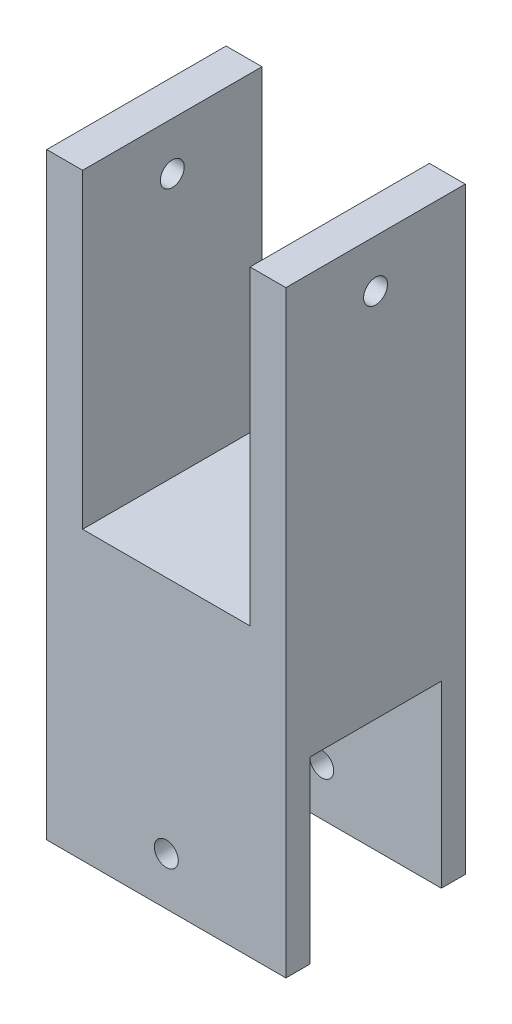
ISO-10303-21;
HEADER;
FILE_DESCRIPTION(('STEP AP214'),'2;1');
FILE_NAME('part.step','',(''),(''),'','','');
FILE_SCHEMA(('AUTOMOTIVE_DESIGN { 1 0 10303 214 1 1 1 1 }'));
ENDSEC;
DATA;
#1=APPLICATION_CONTEXT('core data for automotive mechanical design processes');
#2=APPLICATION_PROTOCOL_DEFINITION('international standard','automotive_design',2000,#1);
#3=PRODUCT_CONTEXT('',#1,'mechanical');
#4=PRODUCT('Part','Part','',(#3));
#5=PRODUCT_RELATED_PRODUCT_CATEGORY('part','',(#4));
#6=PRODUCT_DEFINITION_FORMATION('','',#4);
#7=PRODUCT_DEFINITION_CONTEXT('part definition',#1,'design');
#8=PRODUCT_DEFINITION('design','',#6,#7);
#9=PRODUCT_DEFINITION_SHAPE('','',#8);
#10=(LENGTH_UNIT() NAMED_UNIT(*) SI_UNIT(.MILLI.,.METRE.));
#11=(NAMED_UNIT(*) PLANE_ANGLE_UNIT() SI_UNIT($,.RADIAN.));
#12=(NAMED_UNIT(*) SI_UNIT($,.STERADIAN.) SOLID_ANGLE_UNIT());
#13=UNCERTAINTY_MEASURE_WITH_UNIT(LENGTH_MEASURE(1.E-05),#10,'distance_accuracy_value','');
#14=(GEOMETRIC_REPRESENTATION_CONTEXT(3) GLOBAL_UNCERTAINTY_ASSIGNED_CONTEXT((#13)) GLOBAL_UNIT_ASSIGNED_CONTEXT((#10,
#11,#12)) REPRESENTATION_CONTEXT('',''));
#15=CARTESIAN_POINT('',(0.,0.,0.));
#16=DIRECTION('',(0.,0.,1.));
#17=DIRECTION('',(1.,0.,0.));
#18=AXIS2_PLACEMENT_3D('',#15,#16,#17);
#19=CARTESIAN_POINT('',(30.,-75.,22.5));
#20=DIRECTION('',(0.,1.,0.));
#21=DIRECTION('',(-1.,0.,0.));
#22=AXIS2_PLACEMENT_3D('',#19,#20,#21);
#23=PLANE('',#22);
#24=DIRECTION('',(0.,0.,-1.));
#25=VECTOR('',#24,1.);
#26=CARTESIAN_POINT('',(-30.,-75.,22.5));
#27=LINE('',#26,#25);
#28=CARTESIAN_POINT('',(-30.,-75.,22.5));
#29=VERTEX_POINT('',#28);
#30=CARTESIAN_POINT('',(-30.,-75.,16.5));
#31=VERTEX_POINT('',#30);
#32=EDGE_CURVE('E11',#29,#31,#27,.T.);
#33=ORIENTED_EDGE('',*,*,#32,.T.);
#34=DIRECTION('',(1.,0.,0.));
#35=VECTOR('',#34,1.);
#36=CARTESIAN_POINT('',(-30.,-75.,16.5));
#37=LINE('',#36,#35);
#38=CARTESIAN_POINT('',(30.,-75.,16.5));
#39=VERTEX_POINT('',#38);
#40=EDGE_CURVE('E202',#31,#39,#37,.T.);
#41=ORIENTED_EDGE('',*,*,#40,.T.);
#42=DIRECTION('',(0.,0.,-1.));
#43=VECTOR('',#42,1.);
#44=CARTESIAN_POINT('',(30.,-75.,22.5));
#45=LINE('',#44,#43);
#46=CARTESIAN_POINT('',(30.,-75.,22.5));
#47=VERTEX_POINT('',#46);
#48=EDGE_CURVE('E172',#47,#39,#45,.T.);
#49=ORIENTED_EDGE('',*,*,#48,.F.);
#50=DIRECTION('',(1.,0.,0.));
#51=VECTOR('',#50,1.);
#52=CARTESIAN_POINT('',(30.,-75.,22.5));
#53=LINE('',#52,#51);
#54=EDGE_CURVE('E100',#29,#47,#53,.T.);
#55=ORIENTED_EDGE('',*,*,#54,.F.);
#56=EDGE_LOOP('',(#33,#41,#49,#55));
#57=FACE_BOUND('',#56,.T.);
#58=ADVANCED_FACE('F33',(#57),#23,.F.);
#59=CARTESIAN_POINT('',(0.,-63.,22.5));
#60=DIRECTION('',(0.,0.,-1.));
#61=DIRECTION('',(-1.,0.,0.));
#62=AXIS2_PLACEMENT_3D('',#59,#60,#61);
#63=CYLINDRICAL_SURFACE('',#62,3.);
#64=CARTESIAN_POINT('',(0.,-63.,16.5));
#65=DIRECTION('',(0.,0.,1.));
#66=DIRECTION('',(0.,-1.,0.));
#67=AXIS2_PLACEMENT_3D('',#64,#65,#66);
#68=CIRCLE('',#67,3.);
#69=CARTESIAN_POINT('',(-3.,-63.,16.5));
#70=VERTEX_POINT('',#69);
#71=EDGE_CURVE('E37',#70,#70,#68,.T.);
#72=CARTESIAN_POINT('',(0.,-63.,22.5));
#73=DIRECTION('',(0.,0.,1.));
#74=DIRECTION('',(1.,0.,0.));
#75=AXIS2_PLACEMENT_3D('',#72,#73,#74);
#76=CIRCLE('',#75,3.);
#77=CARTESIAN_POINT('',(-3.,-63.,22.5));
#78=VERTEX_POINT('',#77);
#79=EDGE_CURVE('E148',#78,#78,#76,.T.);
#80=CARTESIAN_POINT('',(-3.,-63.,16.5));
#81=CARTESIAN_POINT('',(-3.,-63.,16.5625));
#82=CARTESIAN_POINT('',(-3.,-63.,16.625));
#83=CARTESIAN_POINT('',(-3.,-63.,16.75));
#84=CARTESIAN_POINT('',(-3.,-63.,16.8125));
#85=CARTESIAN_POINT('',(-3.,-63.,16.9375));
#86=CARTESIAN_POINT('',(-3.,-63.,17.));
#87=CARTESIAN_POINT('',(-3.,-63.,17.125));
#88=CARTESIAN_POINT('',(-3.,-63.,17.1875));
#89=CARTESIAN_POINT('',(-3.,-63.,17.3125));
#90=CARTESIAN_POINT('',(-3.,-63.,17.375));
#91=CARTESIAN_POINT('',(-3.,-63.,17.5));
#92=CARTESIAN_POINT('',(-3.,-63.,17.5625));
#93=CARTESIAN_POINT('',(-3.,-63.,17.6875));
#94=CARTESIAN_POINT('',(-3.,-63.,17.75));
#95=CARTESIAN_POINT('',(-3.,-63.,17.875));
#96=CARTESIAN_POINT('',(-3.,-63.,17.9375));
#97=CARTESIAN_POINT('',(-3.,-63.,18.0625));
#98=CARTESIAN_POINT('',(-3.,-63.,18.125));
#99=CARTESIAN_POINT('',(-3.,-63.,18.25));
#100=CARTESIAN_POINT('',(-3.,-63.,18.3125));
#101=CARTESIAN_POINT('',(-3.,-63.,18.4375));
#102=CARTESIAN_POINT('',(-3.,-63.,18.5));
#103=CARTESIAN_POINT('',(-3.,-63.,18.625));
#104=CARTESIAN_POINT('',(-3.,-63.,18.6875));
#105=CARTESIAN_POINT('',(-3.,-63.,18.8125));
#106=CARTESIAN_POINT('',(-3.,-63.,18.875));
#107=CARTESIAN_POINT('',(-3.,-63.,19.));
#108=CARTESIAN_POINT('',(-3.,-63.,19.0625));
#109=CARTESIAN_POINT('',(-3.,-63.,19.1875));
#110=CARTESIAN_POINT('',(-3.,-63.,19.25));
#111=CARTESIAN_POINT('',(-3.,-63.,19.375));
#112=CARTESIAN_POINT('',(-3.,-63.,19.4375));
#113=CARTESIAN_POINT('',(-3.,-63.,19.5625));
#114=CARTESIAN_POINT('',(-3.,-63.,19.625));
#115=CARTESIAN_POINT('',(-3.,-63.,19.75));
#116=CARTESIAN_POINT('',(-3.,-63.,19.8125));
#117=CARTESIAN_POINT('',(-3.,-63.,19.9375));
#118=CARTESIAN_POINT('',(-3.,-63.,20.));
#119=CARTESIAN_POINT('',(-3.,-63.,20.125));
#120=CARTESIAN_POINT('',(-3.,-63.,20.1875));
#121=CARTESIAN_POINT('',(-3.,-63.,20.3125));
#122=CARTESIAN_POINT('',(-3.,-63.,20.375));
#123=CARTESIAN_POINT('',(-3.,-63.,20.5));
#124=CARTESIAN_POINT('',(-3.,-63.,20.5625));
#125=CARTESIAN_POINT('',(-3.,-63.,20.6875));
#126=CARTESIAN_POINT('',(-3.,-63.,20.75));
#127=CARTESIAN_POINT('',(-3.,-63.,20.875));
#128=CARTESIAN_POINT('',(-3.,-63.,20.9375));
#129=CARTESIAN_POINT('',(-3.,-63.,21.0625));
#130=CARTESIAN_POINT('',(-3.,-63.,21.125));
#131=CARTESIAN_POINT('',(-3.,-63.,21.25));
#132=CARTESIAN_POINT('',(-3.,-63.,21.3125));
#133=CARTESIAN_POINT('',(-3.,-63.,21.4375));
#134=CARTESIAN_POINT('',(-3.,-63.,21.5));
#135=CARTESIAN_POINT('',(-3.,-63.,21.625));
#136=CARTESIAN_POINT('',(-3.,-63.,21.6875));
#137=CARTESIAN_POINT('',(-3.,-63.,21.8125));
#138=CARTESIAN_POINT('',(-3.,-63.,21.875));
#139=CARTESIAN_POINT('',(-3.,-63.,22.));
#140=CARTESIAN_POINT('',(-3.,-63.,22.0625));
#141=CARTESIAN_POINT('',(-3.,-63.,22.1875));
#142=CARTESIAN_POINT('',(-3.,-63.,22.25));
#143=CARTESIAN_POINT('',(-3.,-63.,22.375));
#144=CARTESIAN_POINT('',(-3.,-63.,22.4375));
#145=CARTESIAN_POINT('',(-3.,-63.,22.5));
#146=B_SPLINE_CURVE_WITH_KNOTS('',3,(#80,#81,#82,#83,#84,#85,#86,#87,#88,#89,#90,#91,#92,#93,
#94,#95,#96,#97,#98,#99,#100,#101,#102,#103,#104,#105,#106,#107,#108,#109,#110,#111,#112,#113,
#114,#115,#116,#117,#118,#119,#120,#121,#122,#123,#124,#125,#126,#127,#128,#129,#130,#131,#132,
#133,#134,#135,#136,#137,#138,#139,#140,#141,#142,#143,#144,#145),.UNSPECIFIED.,.F.,.F.,(4,2,2,
2,2,2,2,2,2,2,2,2,2,2,2,2,2,2,2,2,2,2,2,2,2,2,2,2,2,2,2,2,4),(0.,0.1875,0.375,0.5625,
0.750000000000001,0.937500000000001,1.125,1.3125,1.5,1.6875,1.875,2.0625,2.25,2.4375,2.625,
2.8125,3.,3.1875,3.375,3.5625,3.75,3.9375,4.125,4.3125,4.5,4.68749999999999,4.87499999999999,
5.06249999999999,5.24999999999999,5.43749999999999,5.62499999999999,5.81249999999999,
5.99999999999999),.UNSPECIFIED.);
#147=EDGE_CURVE('BSEAM292',#70,#78,#146,.T.);
#148=ORIENTED_EDGE('',*,*,#71,.F.);
#149=ORIENTED_EDGE('',*,*,#79,.T.);
#150=ORIENTED_EDGE('',*,*,#147,.T.);
#151=ORIENTED_EDGE('',*,*,#147,.F.);
#152=EDGE_LOOP('',(#148,#150,#149,#151));
#153=FACE_BOUND('',#152,.T.);
#154=ADVANCED_FACE('F292',(#153),#63,.F.);
#155=CARTESIAN_POINT('',(0.,0.,22.5));
#156=DIRECTION('',(0.,0.,1.));
#157=DIRECTION('',(1.,0.,0.));
#158=AXIS2_PLACEMENT_3D('',#155,#156,#157);
#159=PLANE('',#158);
#160=DIRECTION('',(0.,-1.,0.));
#161=VECTOR('',#160,1.);
#162=CARTESIAN_POINT('',(-30.,-75.,22.5));
#163=LINE('',#162,#161);
#164=CARTESIAN_POINT('',(-30.,75.,22.5));
#165=VERTEX_POINT('',#164);
#166=EDGE_CURVE('E161',#165,#29,#163,.T.);
#167=ORIENTED_EDGE('',*,*,#166,.T.);
#168=ORIENTED_EDGE('',*,*,#54,.T.);
#169=DIRECTION('',(0.,1.,0.));
#170=VECTOR('',#169,1.);
#171=CARTESIAN_POINT('',(30.,-75.,22.5));
#172=LINE('',#171,#170);
#173=CARTESIAN_POINT('',(30.,75.,22.5));
#174=VERTEX_POINT('',#173);
#175=EDGE_CURVE('E218',#47,#174,#172,.T.);
#176=ORIENTED_EDGE('',*,*,#175,.T.);
#177=DIRECTION('',(-1.,0.,0.));
#178=VECTOR('',#177,1.);
#179=CARTESIAN_POINT('',(30.,75.,22.5));
#180=LINE('',#179,#178);
#181=CARTESIAN_POINT('',(21.,75.,22.5));
#182=VERTEX_POINT('',#181);
#183=EDGE_CURVE('E220',#174,#182,#180,.T.);
#184=ORIENTED_EDGE('',*,*,#183,.T.);
#185=DIRECTION('',(0.,-1.,0.));
#186=VECTOR('',#185,1.);
#187=CARTESIAN_POINT('',(21.,-3.,22.5));
#188=LINE('',#187,#186);
#189=CARTESIAN_POINT('',(21.,-3.,22.5));
#190=VERTEX_POINT('',#189);
#191=EDGE_CURVE('E123',#182,#190,#188,.T.);
#192=ORIENTED_EDGE('',*,*,#191,.T.);
#193=DIRECTION('',(-1.,0.,0.));
#194=VECTOR('',#193,1.);
#195=CARTESIAN_POINT('',(21.,-3.,22.5));
#196=LINE('',#195,#194);
#197=CARTESIAN_POINT('',(-21.,-3.,22.5));
#198=VERTEX_POINT('',#197);
#199=EDGE_CURVE('E115',#190,#198,#196,.T.);
#200=ORIENTED_EDGE('',*,*,#199,.T.);
#201=DIRECTION('',(0.,1.,0.));
#202=VECTOR('',#201,1.);
#203=CARTESIAN_POINT('',(-21.,-3.,22.5));
#204=LINE('',#203,#202);
#205=CARTESIAN_POINT('',(-21.,75.,22.5));
#206=VERTEX_POINT('',#205);
#207=EDGE_CURVE('E120',#198,#206,#204,.T.);
#208=ORIENTED_EDGE('',*,*,#207,.T.);
#209=DIRECTION('',(-1.,0.,0.));
#210=VECTOR('',#209,1.);
#211=CARTESIAN_POINT('',(-21.,75.,22.5));
#212=LINE('',#211,#210);
#213=EDGE_CURVE('E59',#206,#165,#212,.T.);
#214=ORIENTED_EDGE('',*,*,#213,.T.);
#215=EDGE_LOOP('',(#167,#168,#176,#184,#192,#200,#208,#214));
#216=FACE_BOUND('',#215,.T.);
#217=ORIENTED_EDGE('',*,*,#79,.F.);
#218=EDGE_LOOP('',(#217));
#219=FACE_BOUND('',#218,.T.);
#220=ADVANCED_FACE('F117',(#216,#219),#159,.T.);
#221=CARTESIAN_POINT('',(0.,0.,-22.5));
#222=DIRECTION('',(0.,0.,1.));
#223=DIRECTION('',(1.,0.,0.));
#224=AXIS2_PLACEMENT_3D('',#221,#222,#223);
#225=PLANE('',#224);
#226=DIRECTION('',(0.,-1.,0.));
#227=VECTOR('',#226,1.);
#228=CARTESIAN_POINT('',(-30.,-75.,-22.5));
#229=LINE('',#228,#227);
#230=CARTESIAN_POINT('',(-30.,75.,-22.5));
#231=VERTEX_POINT('',#230);
#232=CARTESIAN_POINT('',(-30.,-75.,-22.5));
#233=VERTEX_POINT('',#232);
#234=EDGE_CURVE('E144',#231,#233,#229,.T.);
#235=ORIENTED_EDGE('',*,*,#234,.F.);
#236=DIRECTION('',(-1.,0.,0.));
#237=VECTOR('',#236,1.);
#238=CARTESIAN_POINT('',(-21.,75.,-22.5));
#239=LINE('',#238,#237);
#240=CARTESIAN_POINT('',(-21.,75.,-22.5));
#241=VERTEX_POINT('',#240);
#242=EDGE_CURVE('E92',#241,#231,#239,.T.);
#243=ORIENTED_EDGE('',*,*,#242,.F.);
#244=DIRECTION('',(0.,1.,0.));
#245=VECTOR('',#244,1.);
#246=CARTESIAN_POINT('',(-21.,-3.,-22.5));
#247=LINE('',#246,#245);
#248=CARTESIAN_POINT('',(-21.,-3.,-22.5));
#249=VERTEX_POINT('',#248);
#250=EDGE_CURVE('E158',#249,#241,#247,.T.);
#251=ORIENTED_EDGE('',*,*,#250,.F.);
#252=DIRECTION('',(-1.,0.,0.));
#253=VECTOR('',#252,1.);
#254=CARTESIAN_POINT('',(21.,-3.,-22.5));
#255=LINE('',#254,#253);
#256=CARTESIAN_POINT('',(21.,-3.,-22.5));
#257=VERTEX_POINT('',#256);
#258=EDGE_CURVE('E132',#257,#249,#255,.T.);
#259=ORIENTED_EDGE('',*,*,#258,.F.);
#260=DIRECTION('',(0.,-1.,0.));
#261=VECTOR('',#260,1.);
#262=CARTESIAN_POINT('',(21.,-3.,-22.5));
#263=LINE('',#262,#261);
#264=CARTESIAN_POINT('',(21.,75.,-22.5));
#265=VERTEX_POINT('',#264);
#266=EDGE_CURVE('E155',#265,#257,#263,.T.);
#267=ORIENTED_EDGE('',*,*,#266,.F.);
#268=DIRECTION('',(-1.,0.,0.));
#269=VECTOR('',#268,1.);
#270=CARTESIAN_POINT('',(30.,75.,-22.5));
#271=LINE('',#270,#269);
#272=CARTESIAN_POINT('',(30.,75.,-22.5));
#273=VERTEX_POINT('',#272);
#274=EDGE_CURVE('E153',#273,#265,#271,.T.);
#275=ORIENTED_EDGE('',*,*,#274,.F.);
#276=DIRECTION('',(0.,1.,0.));
#277=VECTOR('',#276,1.);
#278=CARTESIAN_POINT('',(30.,-75.,-22.5));
#279=LINE('',#278,#277);
#280=CARTESIAN_POINT('',(30.,-75.,-22.5));
#281=VERTEX_POINT('',#280);
#282=EDGE_CURVE('E151',#281,#273,#279,.T.);
#283=ORIENTED_EDGE('',*,*,#282,.F.);
#284=DIRECTION('',(1.,0.,0.));
#285=VECTOR('',#284,1.);
#286=CARTESIAN_POINT('',(30.,-75.,-22.5));
#287=LINE('',#286,#285);
#288=EDGE_CURVE('E147',#233,#281,#287,.T.);
#289=ORIENTED_EDGE('',*,*,#288,.F.);
#290=EDGE_LOOP('',(#235,#243,#251,#259,#267,#275,#283,#289));
#291=FACE_BOUND('',#290,.T.);
#292=CARTESIAN_POINT('',(0.,-63.,-22.5));
#293=DIRECTION('',(0.,0.,1.));
#294=DIRECTION('',(1.,0.,0.));
#295=AXIS2_PLACEMENT_3D('',#292,#293,#294);
#296=CIRCLE('',#295,3.);
#297=CARTESIAN_POINT('',(-3.,-63.,-22.5));
#298=VERTEX_POINT('',#297);
#299=EDGE_CURVE('E211',#298,#298,#296,.T.);
#300=ORIENTED_EDGE('',*,*,#299,.T.);
#301=EDGE_LOOP('',(#300));
#302=FACE_BOUND('',#301,.T.);
#303=ADVANCED_FACE('F233',(#291,#302),#225,.F.);
#304=CARTESIAN_POINT('',(-30.,-75.,22.5));
#305=DIRECTION('',(1.,0.,0.));
#306=DIRECTION('',(0.,0.,-1.));
#307=AXIS2_PLACEMENT_3D('',#304,#305,#306);
#308=PLANE('',#307);
#309=CARTESIAN_POINT('',(-30.,63.,0.));
#310=DIRECTION('',(1.,0.,0.));
#311=DIRECTION('',(0.,0.,-1.));
#312=AXIS2_PLACEMENT_3D('',#309,#310,#311);
#313=CIRCLE('',#312,3.);
#314=CARTESIAN_POINT('',(-30.,63.,-3.));
#315=VERTEX_POINT('',#314);
#316=EDGE_CURVE('E178',#315,#315,#313,.T.);
#317=ORIENTED_EDGE('',*,*,#316,.T.);
#318=EDGE_LOOP('',(#317));
#319=FACE_BOUND('',#318,.T.);
#320=DIRECTION('',(0.,0.,1.));
#321=VECTOR('',#320,1.);
#322=CARTESIAN_POINT('',(-30.,-30.,-16.5));
#323=LINE('',#322,#321);
#324=CARTESIAN_POINT('',(-30.,-30.,-16.5));
#325=VERTEX_POINT('',#324);
#326=CARTESIAN_POINT('',(-30.,-30.,16.5));
#327=VERTEX_POINT('',#326);
#328=EDGE_CURVE('E198',#325,#327,#323,.T.);
#329=ORIENTED_EDGE('',*,*,#328,.T.);
#330=DIRECTION('',(0.,-1.,0.));
#331=VECTOR('',#330,1.);
#332=CARTESIAN_POINT('',(-30.,-30.,16.5));
#333=LINE('',#332,#331);
#334=EDGE_CURVE('E265',#327,#31,#333,.T.);
#335=ORIENTED_EDGE('',*,*,#334,.T.);
#336=ORIENTED_EDGE('',*,*,#32,.F.);
#337=ORIENTED_EDGE('',*,*,#166,.F.);
#338=DIRECTION('',(0.,0.,-1.));
#339=VECTOR('',#338,1.);
#340=CARTESIAN_POINT('',(-30.,75.,22.5));
#341=LINE('',#340,#339);
#342=EDGE_CURVE('E140',#165,#231,#341,.T.);
#343=ORIENTED_EDGE('',*,*,#342,.T.);
#344=ORIENTED_EDGE('',*,*,#234,.T.);
#345=CARTESIAN_POINT('',(-30.,-75.,-16.5));
#346=VERTEX_POINT('',#345);
#347=EDGE_CURVE('E42',#346,#233,#27,.T.);
#348=ORIENTED_EDGE('',*,*,#347,.F.);
#349=DIRECTION('',(0.,1.,0.));
#350=VECTOR('',#349,1.);
#351=CARTESIAN_POINT('',(-30.,-30.,-16.5));
#352=LINE('',#351,#350);
#353=EDGE_CURVE('E254',#346,#325,#352,.T.);
#354=ORIENTED_EDGE('',*,*,#353,.T.);
#355=EDGE_LOOP('',(#329,#335,#336,#337,#343,#344,#348,#354));
#356=FACE_BOUND('',#355,.T.);
#357=ADVANCED_FACE('F35',(#319,#356),#308,.F.);
#358=CARTESIAN_POINT('',(30.,-75.,-16.5));
#359=VERTEX_POINT('',#358);
#360=EDGE_CURVE('E171',#359,#281,#45,.T.);
#361=ORIENTED_EDGE('',*,*,#360,.F.);
#362=DIRECTION('',(1.,0.,0.));
#363=VECTOR('',#362,1.);
#364=CARTESIAN_POINT('',(-30.,-75.,-16.5));
#365=LINE('',#364,#363);
#366=EDGE_CURVE('E50',#346,#359,#365,.T.);
#367=ORIENTED_EDGE('',*,*,#366,.F.);
#368=ORIENTED_EDGE('',*,*,#347,.T.);
#369=ORIENTED_EDGE('',*,*,#288,.T.);
#370=EDGE_LOOP('',(#361,#367,#368,#369));
#371=FACE_BOUND('',#370,.T.);
#372=ADVANCED_FACE('F257',(#371),#23,.F.);
#373=CARTESIAN_POINT('',(30.,-75.,22.5));
#374=DIRECTION('',(-1.,0.,0.));
#375=DIRECTION('',(0.,0.,1.));
#376=AXIS2_PLACEMENT_3D('',#373,#374,#375);
#377=PLANE('',#376);
#378=CARTESIAN_POINT('',(30.,63.,0.));
#379=DIRECTION('',(1.,0.,0.));
#380=DIRECTION('',(0.,0.,-1.));
#381=AXIS2_PLACEMENT_3D('',#378,#379,#380);
#382=CIRCLE('',#381,3.);
#383=CARTESIAN_POINT('',(30.,63.,-3.));
#384=VERTEX_POINT('',#383);
#385=EDGE_CURVE('E185',#384,#384,#382,.T.);
#386=ORIENTED_EDGE('',*,*,#385,.F.);
#387=EDGE_LOOP('',(#386));
#388=FACE_BOUND('',#387,.T.);
#389=ORIENTED_EDGE('',*,*,#48,.T.);
#390=DIRECTION('',(0.,-1.,0.));
#391=VECTOR('',#390,1.);
#392=CARTESIAN_POINT('',(30.,-30.,16.5));
#393=LINE('',#392,#391);
#394=CARTESIAN_POINT('',(30.,-30.,16.5));
#395=VERTEX_POINT('',#394);
#396=EDGE_CURVE('E263',#395,#39,#393,.T.);
#397=ORIENTED_EDGE('',*,*,#396,.F.);
#398=DIRECTION('',(0.,0.,1.));
#399=VECTOR('',#398,1.);
#400=CARTESIAN_POINT('',(30.,-30.,-16.5));
#401=LINE('',#400,#399);
#402=CARTESIAN_POINT('',(30.,-30.,-16.5));
#403=VERTEX_POINT('',#402);
#404=EDGE_CURVE('E261',#403,#395,#401,.T.);
#405=ORIENTED_EDGE('',*,*,#404,.F.);
#406=DIRECTION('',(0.,1.,0.));
#407=VECTOR('',#406,1.);
#408=CARTESIAN_POINT('',(30.,-30.,-16.5));
#409=LINE('',#408,#407);
#410=EDGE_CURVE('E259',#359,#403,#409,.T.);
#411=ORIENTED_EDGE('',*,*,#410,.F.);
#412=ORIENTED_EDGE('',*,*,#360,.T.);
#413=ORIENTED_EDGE('',*,*,#282,.T.);
#414=DIRECTION('',(0.,0.,-1.));
#415=VECTOR('',#414,1.);
#416=CARTESIAN_POINT('',(30.,75.,22.5));
#417=LINE('',#416,#415);
#418=EDGE_CURVE('E168',#174,#273,#417,.T.);
#419=ORIENTED_EDGE('',*,*,#418,.F.);
#420=ORIENTED_EDGE('',*,*,#175,.F.);
#421=EDGE_LOOP('',(#389,#397,#405,#411,#412,#413,#419,#420));
#422=FACE_BOUND('',#421,.T.);
#423=ADVANCED_FACE('F245',(#388,#422),#377,.F.);
#424=CARTESIAN_POINT('',(30.,75.,22.5));
#425=DIRECTION('',(0.,-1.,0.));
#426=DIRECTION('',(0.,0.,-1.));
#427=AXIS2_PLACEMENT_3D('',#424,#425,#426);
#428=PLANE('',#427);
#429=ORIENTED_EDGE('',*,*,#274,.T.);
#430=DIRECTION('',(0.,0.,-1.));
#431=VECTOR('',#430,1.);
#432=CARTESIAN_POINT('',(21.,75.,22.5));
#433=LINE('',#432,#431);
#434=EDGE_CURVE('E165',#182,#265,#433,.T.);
#435=ORIENTED_EDGE('',*,*,#434,.F.);
#436=ORIENTED_EDGE('',*,*,#183,.F.);
#437=ORIENTED_EDGE('',*,*,#418,.T.);
#438=EDGE_LOOP('',(#429,#435,#436,#437));
#439=FACE_BOUND('',#438,.T.);
#440=ADVANCED_FACE('F226',(#439),#428,.F.);
#441=CARTESIAN_POINT('',(21.,-3.,22.5));
#442=DIRECTION('',(1.,0.,0.));
#443=DIRECTION('',(0.,0.,-1.));
#444=AXIS2_PLACEMENT_3D('',#441,#442,#443);
#445=PLANE('',#444);
#446=CARTESIAN_POINT('',(21.,63.,0.));
#447=DIRECTION('',(1.,0.,0.));
#448=DIRECTION('',(0.,0.,-1.));
#449=AXIS2_PLACEMENT_3D('',#446,#447,#448);
#450=CIRCLE('',#449,3.);
#451=CARTESIAN_POINT('',(21.,63.,-3.));
#452=VERTEX_POINT('',#451);
#453=EDGE_CURVE('E177',#452,#452,#450,.T.);
#454=ORIENTED_EDGE('',*,*,#453,.T.);
#455=EDGE_LOOP('',(#454));
#456=FACE_BOUND('',#455,.T.);
#457=ORIENTED_EDGE('',*,*,#266,.T.);
#458=DIRECTION('',(0.,0.,-1.));
#459=VECTOR('',#458,1.);
#460=CARTESIAN_POINT('',(21.,-3.,22.5));
#461=LINE('',#460,#459);
#462=EDGE_CURVE('E135',#190,#257,#461,.T.);
#463=ORIENTED_EDGE('',*,*,#462,.F.);
#464=ORIENTED_EDGE('',*,*,#191,.F.);
#465=ORIENTED_EDGE('',*,*,#434,.T.);
#466=EDGE_LOOP('',(#457,#463,#464,#465));
#467=FACE_BOUND('',#466,.T.);
#468=ADVANCED_FACE('F230',(#456,#467),#445,.F.);
#469=CARTESIAN_POINT('',(21.,-3.,22.5));
#470=DIRECTION('',(0.,-1.,0.));
#471=DIRECTION('',(0.,0.,-1.));
#472=AXIS2_PLACEMENT_3D('',#469,#470,#471);
#473=PLANE('',#472);
#474=ORIENTED_EDGE('',*,*,#258,.T.);
#475=DIRECTION('',(0.,0.,-1.));
#476=VECTOR('',#475,1.);
#477=CARTESIAN_POINT('',(-21.,-3.,22.5));
#478=LINE('',#477,#476);
#479=EDGE_CURVE('E129',#198,#249,#478,.T.);
#480=ORIENTED_EDGE('',*,*,#479,.F.);
#481=ORIENTED_EDGE('',*,*,#199,.F.);
#482=ORIENTED_EDGE('',*,*,#462,.T.);
#483=EDGE_LOOP('',(#474,#480,#481,#482));
#484=FACE_BOUND('',#483,.T.);
#485=ADVANCED_FACE('F130',(#484),#473,.F.);
#486=CARTESIAN_POINT('',(-21.,-3.,22.5));
#487=DIRECTION('',(-1.,0.,0.));
#488=DIRECTION('',(0.,0.,1.));
#489=AXIS2_PLACEMENT_3D('',#486,#487,#488);
#490=PLANE('',#489);
#491=CARTESIAN_POINT('',(-21.,63.,0.));
#492=DIRECTION('',(-1.,0.,0.));
#493=DIRECTION('',(0.,0.,1.));
#494=AXIS2_PLACEMENT_3D('',#491,#492,#493);
#495=CIRCLE('',#494,3.);
#496=CARTESIAN_POINT('',(-21.,63.,3.));
#497=VERTEX_POINT('',#496);
#498=EDGE_CURVE('E175',#497,#497,#495,.T.);
#499=ORIENTED_EDGE('',*,*,#498,.T.);
#500=EDGE_LOOP('',(#499));
#501=FACE_BOUND('',#500,.T.);
#502=ORIENTED_EDGE('',*,*,#250,.T.);
#503=DIRECTION('',(0.,0.,-1.));
#504=VECTOR('',#503,1.);
#505=CARTESIAN_POINT('',(-21.,75.,22.5));
#506=LINE('',#505,#504);
#507=EDGE_CURVE('E136',#206,#241,#506,.T.);
#508=ORIENTED_EDGE('',*,*,#507,.F.);
#509=ORIENTED_EDGE('',*,*,#207,.F.);
#510=ORIENTED_EDGE('',*,*,#479,.T.);
#511=EDGE_LOOP('',(#502,#508,#509,#510));
#512=FACE_BOUND('',#511,.T.);
#513=ADVANCED_FACE('F138',(#501,#512),#490,.F.);
#514=CARTESIAN_POINT('',(-21.,75.,22.5));
#515=DIRECTION('',(0.,-1.,0.));
#516=DIRECTION('',(0.,0.,-1.));
#517=AXIS2_PLACEMENT_3D('',#514,#515,#516);
#518=PLANE('',#517);
#519=ORIENTED_EDGE('',*,*,#242,.T.);
#520=ORIENTED_EDGE('',*,*,#342,.F.);
#521=ORIENTED_EDGE('',*,*,#213,.F.);
#522=ORIENTED_EDGE('',*,*,#507,.T.);
#523=EDGE_LOOP('',(#519,#520,#521,#522));
#524=FACE_BOUND('',#523,.T.);
#525=ADVANCED_FACE('F235',(#524),#518,.F.);
#526=CARTESIAN_POINT('',(0.,-63.,-16.5));
#527=DIRECTION('',(0.,0.,-1.));
#528=DIRECTION('',(0.,1.,0.));
#529=AXIS2_PLACEMENT_3D('',#526,#527,#528);
#530=CIRCLE('',#529,3.);
#531=CARTESIAN_POINT('',(-3.,-63.,-16.5));
#532=VERTEX_POINT('',#531);
#533=EDGE_CURVE('E179',#532,#532,#530,.T.);
#534=CARTESIAN_POINT('',(-3.,-63.,-16.5));
#535=CARTESIAN_POINT('',(-3.,-63.,-16.5625));
#536=CARTESIAN_POINT('',(-3.,-63.,-16.625));
#537=CARTESIAN_POINT('',(-3.,-63.,-16.75));
#538=CARTESIAN_POINT('',(-3.,-63.,-16.8125));
#539=CARTESIAN_POINT('',(-3.,-63.,-16.9375));
#540=CARTESIAN_POINT('',(-3.,-63.,-17.));
#541=CARTESIAN_POINT('',(-3.,-63.,-17.125));
#542=CARTESIAN_POINT('',(-3.,-63.,-17.1875));
#543=CARTESIAN_POINT('',(-3.,-63.,-17.3125));
#544=CARTESIAN_POINT('',(-3.,-63.,-17.375));
#545=CARTESIAN_POINT('',(-3.,-63.,-17.5));
#546=CARTESIAN_POINT('',(-3.,-63.,-17.5625));
#547=CARTESIAN_POINT('',(-3.,-63.,-17.6875));
#548=CARTESIAN_POINT('',(-3.,-63.,-17.75));
#549=CARTESIAN_POINT('',(-3.,-63.,-17.875));
#550=CARTESIAN_POINT('',(-3.,-63.,-17.9375));
#551=CARTESIAN_POINT('',(-3.,-63.,-18.0625));
#552=CARTESIAN_POINT('',(-3.,-63.,-18.125));
#553=CARTESIAN_POINT('',(-3.,-63.,-18.25));
#554=CARTESIAN_POINT('',(-3.,-63.,-18.3125));
#555=CARTESIAN_POINT('',(-3.,-63.,-18.4375));
#556=CARTESIAN_POINT('',(-3.,-63.,-18.5));
#557=CARTESIAN_POINT('',(-3.,-63.,-18.625));
#558=CARTESIAN_POINT('',(-3.,-63.,-18.6875));
#559=CARTESIAN_POINT('',(-3.,-63.,-18.8125));
#560=CARTESIAN_POINT('',(-3.,-63.,-18.875));
#561=CARTESIAN_POINT('',(-3.,-63.,-19.));
#562=CARTESIAN_POINT('',(-3.,-63.,-19.0625));
#563=CARTESIAN_POINT('',(-3.,-63.,-19.1875));
#564=CARTESIAN_POINT('',(-3.,-63.,-19.25));
#565=CARTESIAN_POINT('',(-3.,-63.,-19.375));
#566=CARTESIAN_POINT('',(-3.,-63.,-19.4375));
#567=CARTESIAN_POINT('',(-3.,-63.,-19.5625));
#568=CARTESIAN_POINT('',(-3.,-63.,-19.625));
#569=CARTESIAN_POINT('',(-3.,-63.,-19.75));
#570=CARTESIAN_POINT('',(-3.,-63.,-19.8125));
#571=CARTESIAN_POINT('',(-3.,-63.,-19.9375));
#572=CARTESIAN_POINT('',(-3.,-63.,-20.));
#573=CARTESIAN_POINT('',(-3.,-63.,-20.125));
#574=CARTESIAN_POINT('',(-3.,-63.,-20.1875));
#575=CARTESIAN_POINT('',(-3.,-63.,-20.3125));
#576=CARTESIAN_POINT('',(-3.,-63.,-20.375));
#577=CARTESIAN_POINT('',(-3.,-63.,-20.5));
#578=CARTESIAN_POINT('',(-3.,-63.,-20.5625));
#579=CARTESIAN_POINT('',(-3.,-63.,-20.6875));
#580=CARTESIAN_POINT('',(-3.,-63.,-20.75));
#581=CARTESIAN_POINT('',(-3.,-63.,-20.875));
#582=CARTESIAN_POINT('',(-3.,-63.,-20.9375));
#583=CARTESIAN_POINT('',(-3.,-63.,-21.0625));
#584=CARTESIAN_POINT('',(-3.,-63.,-21.125));
#585=CARTESIAN_POINT('',(-3.,-63.,-21.25));
#586=CARTESIAN_POINT('',(-3.,-63.,-21.3125));
#587=CARTESIAN_POINT('',(-3.,-63.,-21.4375));
#588=CARTESIAN_POINT('',(-3.,-63.,-21.5));
#589=CARTESIAN_POINT('',(-3.,-63.,-21.625));
#590=CARTESIAN_POINT('',(-3.,-63.,-21.6875));
#591=CARTESIAN_POINT('',(-3.,-63.,-21.8125));
#592=CARTESIAN_POINT('',(-3.,-63.,-21.875));
#593=CARTESIAN_POINT('',(-3.,-63.,-22.));
#594=CARTESIAN_POINT('',(-3.,-63.,-22.0625));
#595=CARTESIAN_POINT('',(-3.,-63.,-22.1875));
#596=CARTESIAN_POINT('',(-3.,-63.,-22.25));
#597=CARTESIAN_POINT('',(-3.,-63.,-22.375));
#598=CARTESIAN_POINT('',(-3.,-63.,-22.4375));
#599=CARTESIAN_POINT('',(-3.,-63.,-22.5));
#600=B_SPLINE_CURVE_WITH_KNOTS('',3,(#534,#535,#536,#537,#538,#539,#540,#541,#542,#543,#544,
#545,#546,#547,#548,#549,#550,#551,#552,#553,#554,#555,#556,#557,#558,#559,#560,#561,#562,#563,
#564,#565,#566,#567,#568,#569,#570,#571,#572,#573,#574,#575,#576,#577,#578,#579,#580,#581,#582,
#583,#584,#585,#586,#587,#588,#589,#590,#591,#592,#593,#594,#595,#596,#597,#598,#599),
.UNSPECIFIED.,.F.,.F.,(4,2,2,2,2,2,2,2,2,2,2,2,2,2,2,2,2,2,2,2,2,2,2,2,2,2,2,2,2,2,2,2,4),(0.,
0.1875,0.375,0.5625,0.750000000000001,0.937500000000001,1.125,1.3125,1.5,1.68750000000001,
1.87500000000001,2.06250000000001,2.25000000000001,2.43750000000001,2.62500000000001,
2.81250000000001,3.00000000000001,3.18750000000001,3.37500000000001,3.56250000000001,
3.75000000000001,3.93750000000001,4.12500000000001,4.31250000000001,4.50000000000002,
4.68750000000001,4.87500000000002,5.06250000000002,5.25000000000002,5.43750000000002,
5.62500000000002,5.81250000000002,6.00000000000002),.UNSPECIFIED.);
#601=EDGE_CURVE('BSEAM298',#532,#298,#600,.T.);
#602=ORIENTED_EDGE('',*,*,#533,.F.);
#603=ORIENTED_EDGE('',*,*,#299,.F.);
#604=ORIENTED_EDGE('',*,*,#601,.T.);
#605=ORIENTED_EDGE('',*,*,#601,.F.);
#606=EDGE_LOOP('',(#602,#604,#603,#605));
#607=FACE_BOUND('',#606,.T.);
#608=ADVANCED_FACE('F298',(#607),#63,.F.);
#609=CARTESIAN_POINT('',(-30.,63.,0.));
#610=DIRECTION('',(1.,0.,0.));
#611=DIRECTION('',(0.,0.,-1.));
#612=AXIS2_PLACEMENT_3D('',#609,#610,#611);
#613=CYLINDRICAL_SURFACE('',#612,3.);
#614=ORIENTED_EDGE('',*,*,#316,.F.);
#615=EDGE_LOOP('',(#614));
#616=FACE_BOUND('',#615,.T.);
#617=ORIENTED_EDGE('',*,*,#498,.F.);
#618=EDGE_LOOP('',(#617));
#619=FACE_BOUND('',#618,.T.);
#620=ADVANCED_FACE('F287',(#616,#619),#613,.F.);
#621=ORIENTED_EDGE('',*,*,#385,.T.);
#622=EDGE_LOOP('',(#621));
#623=FACE_BOUND('',#622,.T.);
#624=ORIENTED_EDGE('',*,*,#453,.F.);
#625=EDGE_LOOP('',(#624));
#626=FACE_BOUND('',#625,.T.);
#627=ADVANCED_FACE('F278',(#623,#626),#613,.F.);
#628=CARTESIAN_POINT('',(-30.,-30.,16.5));
#629=DIRECTION('',(0.,0.,1.));
#630=DIRECTION('',(0.,-1.,0.));
#631=AXIS2_PLACEMENT_3D('',#628,#629,#630);
#632=PLANE('',#631);
#633=ORIENTED_EDGE('',*,*,#71,.T.);
#634=EDGE_LOOP('',(#633));
#635=FACE_BOUND('',#634,.T.);
#636=ORIENTED_EDGE('',*,*,#40,.F.);
#637=ORIENTED_EDGE('',*,*,#334,.F.);
#638=DIRECTION('',(1.,0.,0.));
#639=VECTOR('',#638,1.);
#640=CARTESIAN_POINT('',(-30.,-30.,16.5));
#641=LINE('',#640,#639);
#642=EDGE_CURVE('E181',#327,#395,#641,.T.);
#643=ORIENTED_EDGE('',*,*,#642,.T.);
#644=ORIENTED_EDGE('',*,*,#396,.T.);
#645=EDGE_LOOP('',(#636,#637,#643,#644));
#646=FACE_BOUND('',#645,.T.);
#647=ADVANCED_FACE('F276',(#635,#646),#632,.F.);
#648=CARTESIAN_POINT('',(-30.,-30.,-16.5));
#649=DIRECTION('',(0.,1.,0.));
#650=DIRECTION('',(0.,0.,1.));
#651=AXIS2_PLACEMENT_3D('',#648,#649,#650);
#652=PLANE('',#651);
#653=ORIENTED_EDGE('',*,*,#642,.F.);
#654=ORIENTED_EDGE('',*,*,#328,.F.);
#655=DIRECTION('',(1.,0.,0.));
#656=VECTOR('',#655,1.);
#657=CARTESIAN_POINT('',(-30.,-30.,-16.5));
#658=LINE('',#657,#656);
#659=EDGE_CURVE('E187',#325,#403,#658,.T.);
#660=ORIENTED_EDGE('',*,*,#659,.T.);
#661=ORIENTED_EDGE('',*,*,#404,.T.);
#662=EDGE_LOOP('',(#653,#654,#660,#661));
#663=FACE_BOUND('',#662,.T.);
#664=ADVANCED_FACE('F271',(#663),#652,.F.);
#665=CARTESIAN_POINT('',(-30.,-30.,-16.5));
#666=DIRECTION('',(0.,0.,-1.));
#667=DIRECTION('',(0.,1.,0.));
#668=AXIS2_PLACEMENT_3D('',#665,#666,#667);
#669=PLANE('',#668);
#670=ORIENTED_EDGE('',*,*,#533,.T.);
#671=EDGE_LOOP('',(#670));
#672=FACE_BOUND('',#671,.T.);
#673=ORIENTED_EDGE('',*,*,#659,.F.);
#674=ORIENTED_EDGE('',*,*,#353,.F.);
#675=ORIENTED_EDGE('',*,*,#366,.T.);
#676=ORIENTED_EDGE('',*,*,#410,.T.);
#677=EDGE_LOOP('',(#673,#674,#675,#676));
#678=FACE_BOUND('',#677,.T.);
#679=ADVANCED_FACE('F285',(#672,#678),#669,.F.);
#680=CLOSED_SHELL('',(#58,#154,#220,#303,#357,#372,#423,#440,#468,#485,#513,#525,#608,#620,#627,
#647,#664,#679));
#681=MANIFOLD_SOLID_BREP('B2',#680);
#682=ADVANCED_BREP_SHAPE_REPRESENTATION('',(#18,#681),#14);
#683=SHAPE_DEFINITION_REPRESENTATION(#9,#682);
ENDSEC;
END-ISO-10303-21;
